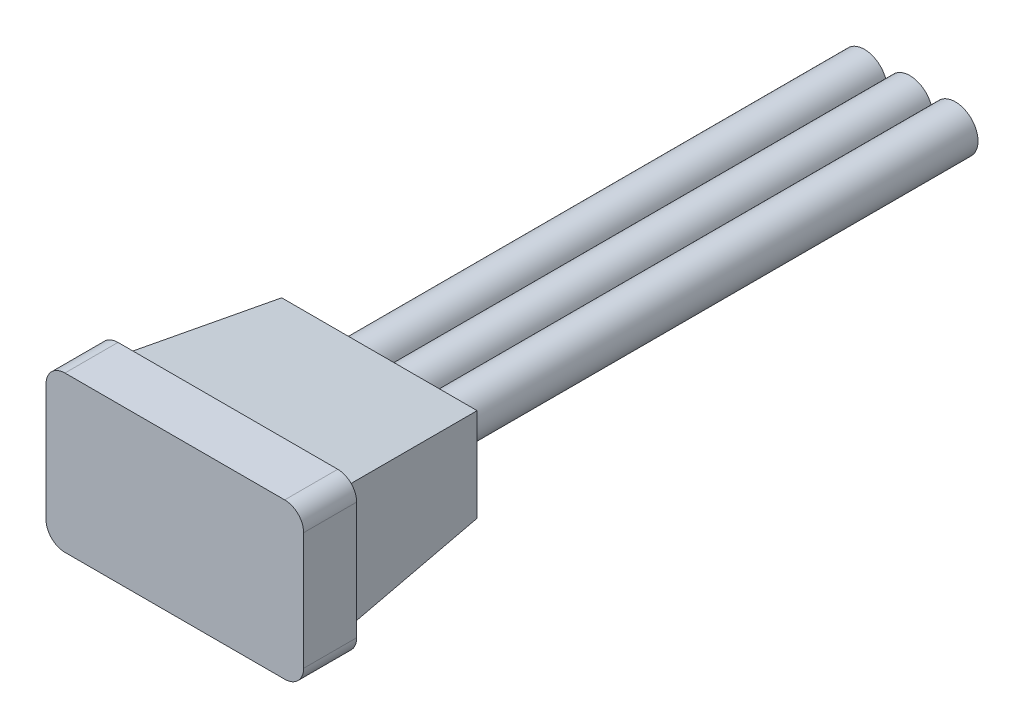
from build123d import *

# Parameters (mm, degrees)
SKETCH1_W           = 6.8
SKETCH1_H           = 4.1
BOSS_EXTRUDE1_DEPTH = 1.4
SKETCH2_W           = 6
SKETCH2_H           = 3.3
BOSS_EXTRUDE2_DEPTH = 4
BOSS_EXTRUDE2_TAPER = 6
FILLET1_R           = 0.5
SKETCH3_R           = 0.6
POSITIVE_DEPTH      = 14
SKETCH4_R           = 0.6
SIGNAL_DEPTH        = 14
SKETCH5_R           = 0.6
NEGATIVE_DEPTH      = 14


with BuildPart() as part:
    # Sketch1 → Boss-Extrude1 (new body)
    with BuildSketch(Plane.XY):
        Rectangle(SKETCH1_W, SKETCH1_H)
    extrude(amount=-BOSS_EXTRUDE1_DEPTH)

    # Sketch2 → Boss-Extrude2 (add)
    with BuildSketch(Plane(origin=(0, 0, -1.4), x_dir=(-1, 0, 0), z_dir=(0, 0, -1))):
        Rectangle(SKETCH2_W, SKETCH2_H)
    extrude(amount=BOSS_EXTRUDE2_DEPTH, taper=BOSS_EXTRUDE2_TAPER)

    # Fillet1
    fillet1_edges = [part.edges().sort_by_distance(p)[0] for p in [
        (3.4, -2.05, -0.7),
        (-3.4, -2.05, -0.7),
        (-3.4, 2.05, -0.7),
        (3.4, 2.05, -0.7),
    ]]
    fillet(fillet1_edges, radius=FILLET1_R)


with BuildPart() as body_2:
    # Sketch3 → POSITIVE (new body)
    with BuildSketch(Plane(origin=(0, 0, -5.4), x_dir=(-1, 0, 0), z_dir=(0, 0, -1))):
        Circle(SKETCH3_R)
    extrude(amount=POSITIVE_DEPTH)


with BuildPart() as body_3:
    # Sketch4 → SIGNAL (new body)
    with BuildSketch(Plane(origin=(0, 0, -5.4), x_dir=(-1, 0, 0), z_dir=(0, 0, -1))):
        with Locations((1.2, 0)):
            Circle(SKETCH4_R)
    extrude(amount=SIGNAL_DEPTH)


with BuildPart() as body_4:
    # Sketch5 → NEGATIVE (new body)
    with BuildSketch(Plane(origin=(0, 0, -5.4), x_dir=(-1, 0, 0), z_dir=(0, 0, -1))):
        with Locations((-1.2, 0)):
            Circle(SKETCH5_R)
    extrude(amount=NEGATIVE_DEPTH)


solid = Compound([part.part, body_2.part, body_3.part, body_4.part])
